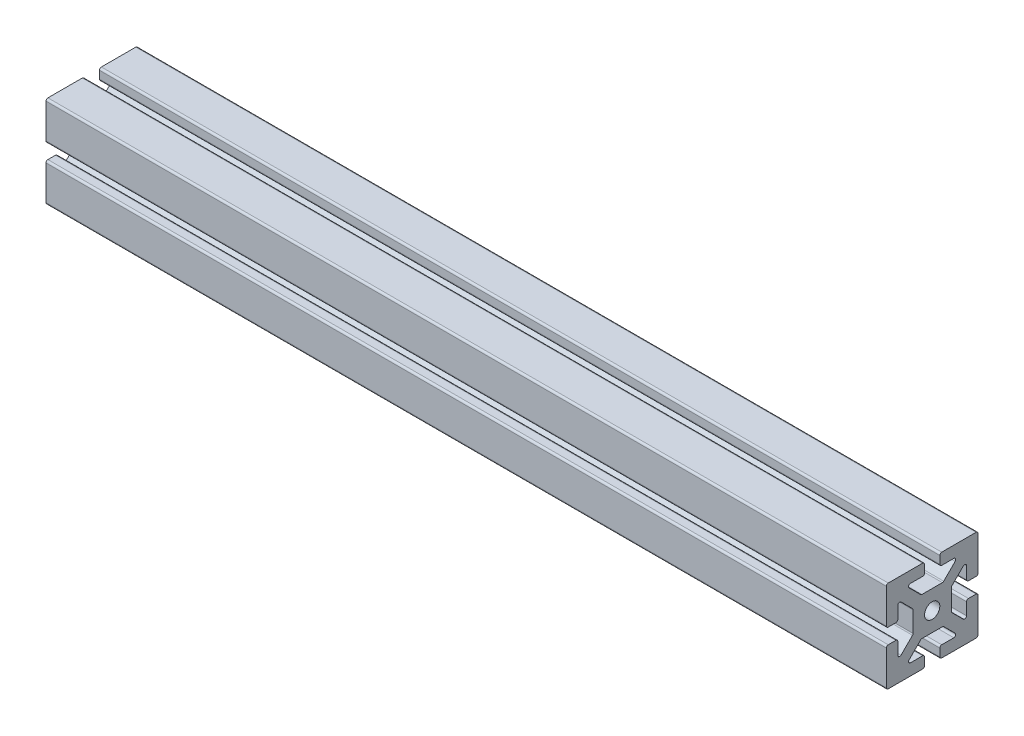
from build123d import *

# Parameters (mm, degrees)
SKETCH1_R           = 1
BOSS_EXTRUDE1_DEPTH = 110


with BuildPart() as part:
    # Sketch1 → Boss-Extrude1 (new body)
    with BuildSketch(Plane(origin=(0, 0, 0), x_dir=(0, 0, -1), z_dir=(1, 0, 0))):
        with BuildLine():
            Line((2.573223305, 1.512563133), (4.073223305, 3.012563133))
            ThreePointArc((4.073223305, 3.012563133), (4.345670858, 3.066756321), (4.5, 2.835786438))
            Line((4.5, 2.835786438), (4.5, 1.25))
            ThreePointArc((4.5, 1.25), (4.573223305, 1.073223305), (4.75, 1))
            Line((4.75, 1), (5.75, 1))
            ThreePointArc((5.75, 1), (5.926776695, 1.073223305), (6, 1.25))
            Line((6, 1.25), (6, 5.75))
            ThreePointArc((6, 5.75), (5.926776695, 5.926776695), (5.75, 6))
            Line((5.75, 6), (1.25, 6))
            ThreePointArc((1.25, 6), (1.073223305, 5.926776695), (1, 5.75))
            Line((1, 5.75), (1, 4.75))
            ThreePointArc((1, 4.75), (1.073223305, 4.573223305), (1.25, 4.5))
            Line((1.25, 4.5), (2.835786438, 4.5))
            ThreePointArc((2.835786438, 4.5), (3.066756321, 4.345670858), (3.012563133, 4.073223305))
            Line((3.012563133, 4.073223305), (1.512563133, 2.573223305))
            ThreePointArc((1.512563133, 2.573223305), (1.431457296, 2.519030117), (1.335786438, 2.5))
            Line((1.335786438, 2.5), (-1.335786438, 2.5))
            ThreePointArc((-1.335786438, 2.5), (-1.431457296, 2.519030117), (-1.512563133, 2.573223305))
            Line((-1.512563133, 2.573223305), (-3.012563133, 4.073223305))
            ThreePointArc((-3.012563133, 4.073223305), (-3.066756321, 4.345670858), (-2.835786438, 4.5))
            Line((-2.835786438, 4.5), (-1.25, 4.5))
            ThreePointArc((-1.25, 4.5), (-1.073223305, 4.573223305), (-1, 4.75))
            Line((-1, 4.75), (-1, 5.75))
            ThreePointArc((-1, 5.75), (-1.073223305, 5.926776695), (-1.25, 6))
            Line((-1.25, 6), (-5.75, 6))
            ThreePointArc((-5.75, 6), (-5.926776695, 5.926776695), (-6, 5.75))
            Line((-6, 5.75), (-6, 1.25))
            ThreePointArc((-6, 1.25), (-5.926776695, 1.073223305), (-5.75, 1))
            Line((-5.75, 1), (-4.75, 1))
            ThreePointArc((-4.75, 1), (-4.573223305, 1.073223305), (-4.5, 1.25))
            Line((-4.5, 1.25), (-4.5, 2.835786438))
            ThreePointArc((-4.5, 2.835786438), (-4.345670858, 3.066756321), (-4.073223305, 3.012563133))
            Line((-4.073223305, 3.012563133), (-2.573223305, 1.512563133))
            ThreePointArc((-2.573223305, 1.512563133), (-2.519030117, 1.431457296), (-2.5, 1.335786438))
            Line((-2.5, 1.335786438), (-2.5, -1.335786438))
            ThreePointArc((-2.5, -1.335786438), (-2.519030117, -1.431457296), (-2.573223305, -1.512563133))
            Line((-2.573223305, -1.512563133), (-4.073223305, -3.012563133))
            ThreePointArc((-4.073223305, -3.012563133), (-4.345670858, -3.066756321), (-4.5, -2.835786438))
            Line((-4.5, -2.835786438), (-4.5, -1.25))
            ThreePointArc((-4.5, -1.25), (-4.573223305, -1.073223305), (-4.75, -1))
            Line((-4.75, -1), (-5.75, -1))
            ThreePointArc((-5.75, -1), (-5.926776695, -1.073223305), (-6, -1.25))
            Line((-6, -1.25), (-6, -5.75))
            ThreePointArc((-6, -5.75), (-5.926776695, -5.926776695), (-5.75, -6))
            Line((-5.75, -6), (-1.25, -6))
            ThreePointArc((-1.25, -6), (-1.073223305, -5.926776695), (-1, -5.75))
            Line((-1, -5.75), (-1, -4.75))
            ThreePointArc((-1, -4.75), (-1.073223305, -4.573223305), (-1.25, -4.5))
            Line((-1.25, -4.5), (-2.835786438, -4.5))
            ThreePointArc((-2.835786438, -4.5), (-3.066756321, -4.345670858), (-3.012563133, -4.073223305))
            Line((-3.012563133, -4.073223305), (-1.512563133, -2.573223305))
            ThreePointArc((-1.512563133, -2.573223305), (-1.431457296, -2.519030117), (-1.335786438, -2.5))
            Line((-1.335786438, -2.5), (1.335786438, -2.5))
            ThreePointArc((1.335786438, -2.5), (1.431457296, -2.519030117), (1.512563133, -2.573223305))
            Line((1.512563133, -2.573223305), (3.012563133, -4.073223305))
            ThreePointArc((3.012563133, -4.073223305), (3.066756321, -4.345670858), (2.835786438, -4.5))
            Line((2.835786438, -4.5), (1.25, -4.5))
            ThreePointArc((1.25, -4.5), (1.073223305, -4.573223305), (1, -4.75))
            Line((1, -4.75), (1, -5.75))
            ThreePointArc((1, -5.75), (1.073223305, -5.926776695), (1.25, -6))
            Line((1.25, -6), (5.75, -6))
            ThreePointArc((5.75, -6), (5.926776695, -5.926776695), (6, -5.75))
            Line((6, -5.75), (6, -1.25))
            ThreePointArc((6, -1.25), (5.926776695, -1.073223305), (5.75, -1))
            Line((5.75, -1), (4.75, -1))
            ThreePointArc((4.75, -1), (4.573223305, -1.073223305), (4.5, -1.25))
            Line((4.5, -1.25), (4.5, -2.835786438))
            ThreePointArc((4.5, -2.835786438), (4.345670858, -3.066756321), (4.073223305, -3.012563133))
            Line((4.073223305, -3.012563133), (2.573223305, -1.512563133))
            ThreePointArc((2.573223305, -1.512563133), (2.519030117, -1.431457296), (2.5, -1.335786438))
            Line((2.5, -1.335786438), (2.5, 1.335786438))
            ThreePointArc((2.5, 1.335786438), (2.519030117, 1.431457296), (2.573223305, 1.512563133))
        make_face()
        Circle(SKETCH1_R, mode=Mode.SUBTRACT)
    extrude(amount=-BOSS_EXTRUDE1_DEPTH)


solid = part.part
